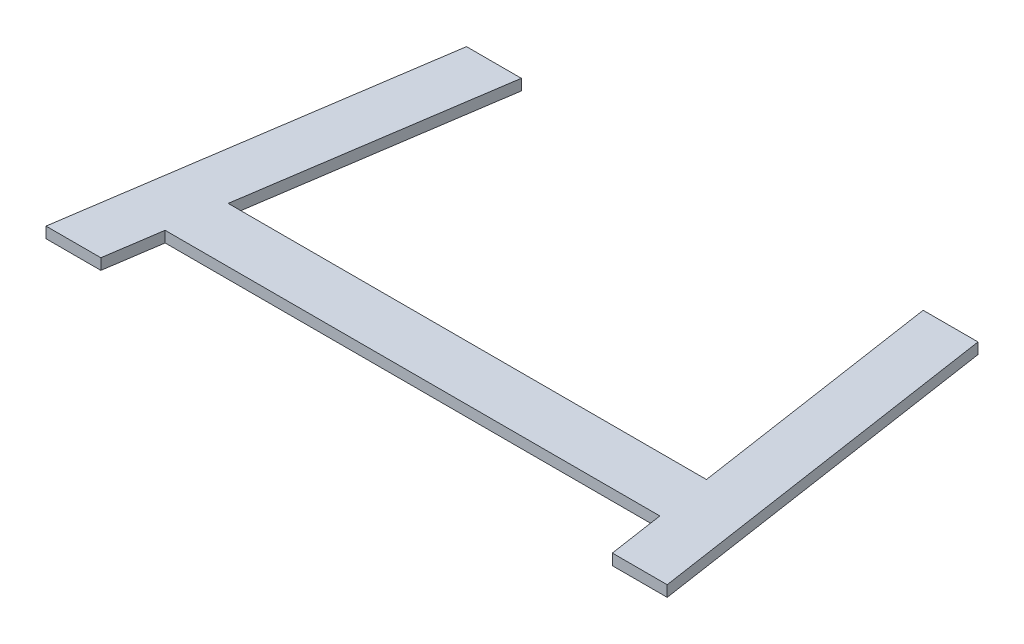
from build123d import *

# Parameters (mm, degrees)
BOSS_EXTRUDE1_DEPTH = 12


with BuildPart() as part:
    # Sketch1 → Boss-Extrude1 (new body)
    with BuildSketch(Plane(origin=(0, 0, 0), x_dir=(1, 0, 0), z_dir=(0, 1, 0))):
        Polygon((-30, 200), (30, 200), (-11.829162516, -78.861083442), (511.369162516, -78.861083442), (469.54, 200), (529.54, 200), (589.54, -200), (529.54, -200), (520.369162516, -138.861083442), (-20.829162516, -138.861083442), (-30, -200), (-90, -200), align=None)
    extrude(amount=BOSS_EXTRUDE1_DEPTH)


solid = part.part
